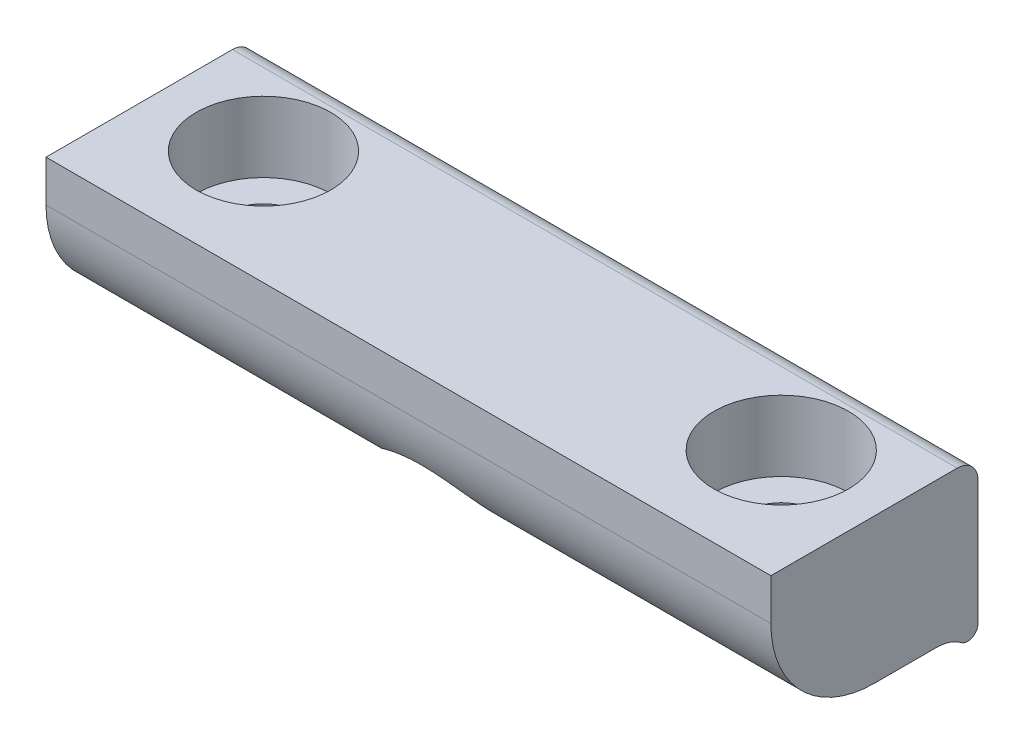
ISO-10303-21;
HEADER;
FILE_DESCRIPTION(('STEP AP214'),'2;1');
FILE_NAME('part.step','',(''),(''),'','','');
FILE_SCHEMA(('AUTOMOTIVE_DESIGN { 1 0 10303 214 1 1 1 1 }'));
ENDSEC;
DATA;
#1=APPLICATION_CONTEXT('core data for automotive mechanical design processes');
#2=APPLICATION_PROTOCOL_DEFINITION('international standard','automotive_design',2000,#1);
#3=PRODUCT_CONTEXT('',#1,'mechanical');
#4=PRODUCT('Part','Part','',(#3));
#5=PRODUCT_RELATED_PRODUCT_CATEGORY('part','',(#4));
#6=PRODUCT_DEFINITION_FORMATION('','',#4);
#7=PRODUCT_DEFINITION_CONTEXT('part definition',#1,'design');
#8=PRODUCT_DEFINITION('design','',#6,#7);
#9=PRODUCT_DEFINITION_SHAPE('','',#8);
#10=(LENGTH_UNIT() NAMED_UNIT(*) SI_UNIT(.MILLI.,.METRE.));
#11=(NAMED_UNIT(*) PLANE_ANGLE_UNIT() SI_UNIT($,.RADIAN.));
#12=(NAMED_UNIT(*) SI_UNIT($,.STERADIAN.) SOLID_ANGLE_UNIT());
#13=UNCERTAINTY_MEASURE_WITH_UNIT(LENGTH_MEASURE(1.E-05),#10,'distance_accuracy_value','');
#14=(GEOMETRIC_REPRESENTATION_CONTEXT(3) GLOBAL_UNCERTAINTY_ASSIGNED_CONTEXT((#13)) GLOBAL_UNIT_ASSIGNED_CONTEXT((#10,
#11,#12)) REPRESENTATION_CONTEXT('',''));
#15=CARTESIAN_POINT('',(0.,0.,0.));
#16=DIRECTION('',(0.,0.,1.));
#17=DIRECTION('',(1.,0.,0.));
#18=AXIS2_PLACEMENT_3D('',#15,#16,#17);
#19=CARTESIAN_POINT('',(-35.,-2.,2.));
#20=DIRECTION('',(1.,0.,0.));
#21=DIRECTION('',(0.,0.,-1.));
#22=AXIS2_PLACEMENT_3D('',#19,#20,#21);
#23=CYLINDRICAL_SURFACE('',#22,2.);
#24=CARTESIAN_POINT('',(-21.2619808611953,0.,2.));
#25=CARTESIAN_POINT('',(-21.261971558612,2.5680852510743E-06,1.94495750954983));
#26=CARTESIAN_POINT('',(-21.2628879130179,-0.00227351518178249,1.88994436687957));
#27=CARTESIAN_POINT('',(-21.2664861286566,-0.0113362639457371,1.78036940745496));
#28=CARTESIAN_POINT('',(-21.2691673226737,-0.0181212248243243,1.72580742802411));
#29=CARTESIAN_POINT('',(-21.2795361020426,-0.0446738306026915,1.56631649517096));
#30=CARTESIAN_POINT('',(-21.2895603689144,-0.0706509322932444,1.46250286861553));
#31=CARTESIAN_POINT('',(-21.3143441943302,-0.138178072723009,1.26194890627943));
#32=CARTESIAN_POINT('',(-21.3290557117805,-0.17957080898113,1.16514853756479));
#33=CARTESIAN_POINT('',(-21.3616131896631,-0.278066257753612,0.976983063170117));
#34=CARTESIAN_POINT('',(-21.3795338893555,-0.335567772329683,0.885839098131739));
#35=CARTESIAN_POINT('',(-21.3977557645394,-0.4,0.799999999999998));
#36=B_SPLINE_CURVE_WITH_KNOTS('',3,(#24,#25,#26,#27,#28,#29,#30,#31,#32,#33,#34,#35),
.UNSPECIFIED.,.F.,.F.,(4,2,2,2,2,4),(0.,0.165016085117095,0.329969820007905,0.650763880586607,
0.968370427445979,1.2946658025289),.UNSPECIFIED.);
#37=CARTESIAN_POINT('',(-21.2619808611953,0.,2.));
#38=VERTEX_POINT('',#37);
#39=CARTESIAN_POINT('',(-21.3977557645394,-0.4,0.799999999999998));
#40=VERTEX_POINT('',#39);
#41=EDGE_CURVE('E213',#38,#40,#36,.T.);
#42=ORIENTED_EDGE('',*,*,#41,.F.);
#43=DIRECTION('',(1.,0.,0.));
#44=VECTOR('',#43,1.);
#45=CARTESIAN_POINT('',(-35.,0.,2.));
#46=LINE('',#45,#44);
#47=CARTESIAN_POINT('',(-35.,0.,2.));
#48=VERTEX_POINT('',#47);
#49=EDGE_CURVE('E159',#48,#38,#46,.T.);
#50=ORIENTED_EDGE('',*,*,#49,.F.);
#51=CARTESIAN_POINT('',(-35.,-2.,2.));
#52=DIRECTION('',(-1.,0.,0.));
#53=DIRECTION('',(0.,0.,-1.));
#54=AXIS2_PLACEMENT_3D('',#51,#52,#53);
#55=CIRCLE('',#54,2.);
#56=CARTESIAN_POINT('',(-35.,-0.4,0.799999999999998));
#57=VERTEX_POINT('',#56);
#58=EDGE_CURVE('E211',#48,#57,#55,.T.);
#59=ORIENTED_EDGE('',*,*,#58,.T.);
#60=DIRECTION('',(1.,0.,0.));
#61=VECTOR('',#60,1.);
#62=CARTESIAN_POINT('',(-35.,-0.4,0.799999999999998));
#63=LINE('',#62,#61);
#64=EDGE_CURVE('E313',#57,#40,#63,.T.);
#65=ORIENTED_EDGE('',*,*,#64,.T.);
#66=EDGE_LOOP('',(#42,#50,#59,#65));
#67=FACE_BOUND('',#66,.T.);
#68=ADVANCED_FACE('F34',(#67),#23,.F.);
#69=CARTESIAN_POINT('',(-35.,0.,2.));
#70=DIRECTION('',(0.,-1.,0.));
#71=DIRECTION('',(0.,0.,-1.));
#72=AXIS2_PLACEMENT_3D('',#69,#70,#71);
#73=PLANE('',#72);
#74=CARTESIAN_POINT('',(-30.,0.,4.5));
#75=DIRECTION('',(0.,-1.,0.));
#76=DIRECTION('',(0.,0.,-1.));
#77=AXIS2_PLACEMENT_3D('',#74,#75,#76);
#78=CIRCLE('',#77,1.7);
#79=CARTESIAN_POINT('',(-31.6248076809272,0.,4.99999999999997));
#80=VERTEX_POINT('',#79);
#81=CARTESIAN_POINT('',(-28.3751923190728,0.,4.99999999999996));
#82=VERTEX_POINT('',#81);
#83=EDGE_CURVE('E53',#80,#82,#78,.T.);
#84=ORIENTED_EDGE('',*,*,#83,.F.);
#85=DIRECTION('',(1.,0.,0.));
#86=VECTOR('',#85,1.);
#87=CARTESIAN_POINT('',(-35.,0.,4.99999999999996));
#88=LINE('',#87,#86);
#89=CARTESIAN_POINT('',(-35.,0.,4.99999999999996));
#90=VERTEX_POINT('',#89);
#91=EDGE_CURVE('E145',#90,#80,#88,.T.);
#92=ORIENTED_EDGE('',*,*,#91,.F.);
#93=DIRECTION('',(0.,0.,-1.));
#94=VECTOR('',#93,1.);
#95=CARTESIAN_POINT('',(-35.,0.,2.));
#96=LINE('',#95,#94);
#97=EDGE_CURVE('E205',#90,#48,#96,.T.);
#98=ORIENTED_EDGE('',*,*,#97,.T.);
#99=ORIENTED_EDGE('',*,*,#49,.T.);
#100=DIRECTION('',(0.,0.,-1.));
#101=VECTOR('',#100,1.);
#102=CARTESIAN_POINT('',(-21.2619808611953,0.,10.));
#103=LINE('',#102,#101);
#104=CARTESIAN_POINT('',(-21.2619808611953,0.,4.99999999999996));
#105=VERTEX_POINT('',#104);
#106=EDGE_CURVE('E204',#105,#38,#103,.T.);
#107=ORIENTED_EDGE('',*,*,#106,.F.);
#108=EDGE_CURVE('E148',#82,#105,#88,.T.);
#109=ORIENTED_EDGE('',*,*,#108,.F.);
#110=EDGE_LOOP('',(#84,#92,#98,#99,#107,#109));
#111=FACE_BOUND('',#110,.T.);
#112=ADVANCED_FACE('F143',(#111),#73,.T.);
#113=CARTESIAN_POINT('',(-35.,0.,0.499999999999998));
#114=DIRECTION('',(1.,0.,0.));
#115=DIRECTION('',(0.,0.,-1.));
#116=AXIS2_PLACEMENT_3D('',#113,#114,#115);
#117=CYLINDRICAL_SURFACE('',#116,0.5);
#118=CARTESIAN_POINT('',(-13.7380191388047,0.,0.));
#119=CARTESIAN_POINT('',(-13.7265863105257,-0.0286359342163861,-2.24437898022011E-05));
#120=CARTESIAN_POINT('',(-13.715497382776,-0.0574339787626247,0.00246020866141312));
#121=CARTESIAN_POINT('',(-13.6942239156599,-0.114550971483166,0.0124402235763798));
#122=CARTESIAN_POINT('',(-13.6840411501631,-0.142868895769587,0.0199471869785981));
#123=CARTESIAN_POINT('',(-13.6648222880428,-0.198163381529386,0.0400012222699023));
#124=CARTESIAN_POINT('',(-13.6557886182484,-0.225137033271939,0.0525587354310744));
#125=CARTESIAN_POINT('',(-13.6390710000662,-0.276701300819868,0.0824798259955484));
#126=CARTESIAN_POINT('',(-13.6313854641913,-0.30129470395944,0.0998376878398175));
#127=CARTESIAN_POINT('',(-13.617800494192,-0.346072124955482,0.13798233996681));
#128=CARTESIAN_POINT('',(-13.6118323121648,-0.366412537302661,0.158561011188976));
#129=CARTESIAN_POINT('',(-13.6012462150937,-0.403373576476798,0.203137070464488));
#130=CARTESIAN_POINT('',(-13.5966283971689,-0.419993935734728,0.227134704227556));
#131=CARTESIAN_POINT('',(-13.5889314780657,-0.448216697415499,0.276667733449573));
#132=CARTESIAN_POINT('',(-13.5857918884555,-0.460013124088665,0.302083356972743));
#133=CARTESIAN_POINT('',(-13.5807392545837,-0.47921865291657,0.35463298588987));
#134=CARTESIAN_POINT('',(-13.5788259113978,-0.48662882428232,0.381766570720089));
#135=CARTESIAN_POINT('',(-13.5762408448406,-0.496685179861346,0.436315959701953));
#136=CARTESIAN_POINT('',(-13.575541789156,-0.499436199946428,0.463711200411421));
#137=CARTESIAN_POINT('',(-13.5752943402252,-0.500407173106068,0.518590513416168));
#138=CARTESIAN_POINT('',(-13.5757460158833,-0.498626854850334,0.546074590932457));
#139=CARTESIAN_POINT('',(-13.5777969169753,-0.490624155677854,0.600152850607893));
#140=CARTESIAN_POINT('',(-13.5793885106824,-0.484431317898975,0.626751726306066));
#141=CARTESIAN_POINT('',(-13.5837234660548,-0.467841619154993,0.678496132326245));
#142=CARTESIAN_POINT('',(-13.5864659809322,-0.457447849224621,0.703642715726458));
#143=CARTESIAN_POINT('',(-13.5915408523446,-0.438636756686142,0.740421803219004));
#144=CARTESIAN_POINT('',(-13.593457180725,-0.431597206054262,0.752837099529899));
#145=CARTESIAN_POINT('',(-13.5976100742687,-0.416527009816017,0.776960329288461));
#146=CARTESIAN_POINT('',(-13.5998460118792,-0.408498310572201,0.788669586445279));
#147=CARTESIAN_POINT('',(-13.6022442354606,-0.4,0.799999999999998));
#148=B_SPLINE_CURVE_WITH_KNOTS('',3,(#118,#119,#120,#121,#122,#123,#124,#125,#126,#127,#128,
#129,#130,#131,#132,#133,#134,#135,#136,#137,#138,#139,#140,#141,#142,#143,#144,#145,#146,#147),
.UNSPECIFIED.,.F.,.F.,(4,2,2,2,2,2,2,2,2,2,2,2,2,2,4),(0.,0.0924351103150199,0.185047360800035,
0.277852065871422,0.37054674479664,0.458727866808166,0.546915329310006,0.631087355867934,
0.715238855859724,0.797470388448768,0.879706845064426,0.961397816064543,1.04302878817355,
1.08618114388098,1.12924990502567),.UNSPECIFIED.);
#149=CARTESIAN_POINT('',(-13.7380191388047,0.,0.));
#150=VERTEX_POINT('',#149);
#151=CARTESIAN_POINT('',(-13.6022442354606,-0.4,0.799999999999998));
#152=VERTEX_POINT('',#151);
#153=EDGE_CURVE('E261',#150,#152,#148,.T.);
#154=ORIENTED_EDGE('',*,*,#153,.F.);
#155=DIRECTION('',(1.,0.,0.));
#156=VECTOR('',#155,1.);
#157=CARTESIAN_POINT('',(-35.,0.,0.));
#158=LINE('',#157,#156);
#159=CARTESIAN_POINT('',(0.,0.,0.));
#160=VERTEX_POINT('',#159);
#161=EDGE_CURVE('E307',#160,#150,#158,.F.);
#162=ORIENTED_EDGE('',*,*,#161,.F.);
#163=CARTESIAN_POINT('',(0.,0.,0.499999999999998));
#164=DIRECTION('',(-1.,0.,0.));
#165=DIRECTION('',(0.,0.,1.));
#166=AXIS2_PLACEMENT_3D('',#163,#164,#165);
#167=CIRCLE('',#166,0.5);
#168=CARTESIAN_POINT('',(0.,-0.4,0.799999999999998));
#169=VERTEX_POINT('',#168);
#170=EDGE_CURVE('E312',#169,#160,#167,.F.);
#171=ORIENTED_EDGE('',*,*,#170,.F.);
#172=EDGE_CURVE('E200',#152,#169,#63,.T.);
#173=ORIENTED_EDGE('',*,*,#172,.F.);
#174=EDGE_LOOP('',(#154,#162,#171,#173));
#175=FACE_BOUND('',#174,.T.);
#176=ADVANCED_FACE('F283',(#175),#117,.T.);
#177=CARTESIAN_POINT('',(-35.,5.,5.));
#178=DIRECTION('',(1.,0.,0.));
#179=DIRECTION('',(0.,0.,-1.));
#180=AXIS2_PLACEMENT_3D('',#177,#178,#179);
#181=CYLINDRICAL_SURFACE('',#180,5.);
#182=CARTESIAN_POINT('',(-28.3751923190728,0.,4.99999999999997));
#183=CARTESIAN_POINT('',(-28.389055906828,-2.95487882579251E-06,5.04505420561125));
#184=CARTESIAN_POINT('',(-28.40478860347,0.000609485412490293,5.08950636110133));
#185=CARTESIAN_POINT('',(-28.4398708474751,0.00294019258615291,5.17691616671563));
#186=CARTESIAN_POINT('',(-28.4592194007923,0.00465815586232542,5.21987422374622));
#187=CARTESIAN_POINT('',(-28.5223972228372,0.011270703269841,5.34586395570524));
#188=CARTESIAN_POINT('',(-28.5714406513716,0.0176253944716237,5.4262762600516));
#189=CARTESIAN_POINT('',(-28.6818950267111,0.0328985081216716,5.57767860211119));
#190=CARTESIAN_POINT('',(-28.7432998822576,0.0418156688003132,5.64867325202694));
#191=CARTESIAN_POINT('',(-28.8768723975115,0.0607054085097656,5.7795812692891));
#192=CARTESIAN_POINT('',(-28.9490439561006,0.0706783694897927,5.83949060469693));
#193=CARTESIAN_POINT('',(-29.1040895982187,0.0903619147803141,5.94793039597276));
#194=CARTESIAN_POINT('',(-29.1871746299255,0.100060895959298,5.99616172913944));
#195=CARTESIAN_POINT('',(-29.360455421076,0.117416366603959,6.07802459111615));
#196=CARTESIAN_POINT('',(-29.4506507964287,0.125072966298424,6.11165690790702));
#197=CARTESIAN_POINT('',(-29.635135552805,0.137095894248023,6.16312761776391));
#198=CARTESIAN_POINT('',(-29.7294001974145,0.141479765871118,6.18105031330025));
#199=CARTESIAN_POINT('',(-29.9196895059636,0.146320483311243,6.20079267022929));
#200=CARTESIAN_POINT('',(-30.0157137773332,0.146778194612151,6.20261588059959));
#201=CARTESIAN_POINT('',(-30.2041303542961,0.143736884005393,6.19027000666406));
#202=CARTESIAN_POINT('',(-30.2965520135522,0.140340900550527,6.17651740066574));
#203=CARTESIAN_POINT('',(-30.4777343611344,0.130278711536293,6.13414425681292));
#204=CARTESIAN_POINT('',(-30.5664947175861,0.123612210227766,6.10552237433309));
#205=CARTESIAN_POINT('',(-30.738533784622,0.107957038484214,6.03404781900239));
#206=CARTESIAN_POINT('',(-30.8217733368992,0.0989536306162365,5.99110432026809));
#207=CARTESIAN_POINT('',(-30.980033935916,0.0799907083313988,5.89220810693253));
#208=CARTESIAN_POINT('',(-31.0550524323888,0.0700308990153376,5.83625137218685));
#209=CARTESIAN_POINT('',(-31.1968423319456,0.0504083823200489,5.71109556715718));
#210=CARTESIAN_POINT('',(-31.2633365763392,0.0407609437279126,5.64157991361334));
#211=CARTESIAN_POINT('',(-31.3837361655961,0.0237194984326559,5.49219747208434));
#212=CARTESIAN_POINT('',(-31.4376538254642,0.0163232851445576,5.41234093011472));
#213=CARTESIAN_POINT('',(-31.5135233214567,0.00737295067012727,5.27640770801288));
#214=CARTESIAN_POINT('',(-31.5398431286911,0.00466701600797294,5.22279857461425));
#215=CARTESIAN_POINT('',(-31.5867107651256,0.00097641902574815,5.11311337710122));
#216=CARTESIAN_POINT('',(-31.6072635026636,-9.71076704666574E-06,5.05703945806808));
#217=CARTESIAN_POINT('',(-31.6248076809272,0.,4.99999999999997));
#218=B_SPLINE_CURVE_WITH_KNOTS('',3,(#182,#183,#184,#185,#186,#187,#188,#189,#190,#191,#192,
#193,#194,#195,#196,#197,#198,#199,#200,#201,#202,#203,#204,#205,#206,#207,#208,#209,#210,#211,
#212,#213,#214,#215,#216,#217),.UNSPECIFIED.,.F.,.F.,(4,2,2,2,2,2,2,2,2,2,2,2,2,2,2,2,2,4),(0.,
0.141322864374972,0.282606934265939,0.564353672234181,0.845961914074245,1.12767238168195,
1.41597592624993,1.70426390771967,1.99099520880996,2.27766330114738,2.55684356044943,
2.83604907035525,3.11706004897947,3.39815795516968,3.68684090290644,3.97523997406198,
4.1542617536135,4.33313070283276),.UNSPECIFIED.);
#219=EDGE_CURVE('E11',#82,#80,#218,.T.);
#220=ORIENTED_EDGE('',*,*,#219,.F.);
#221=ORIENTED_EDGE('',*,*,#108,.T.);
#222=CARTESIAN_POINT('',(-13.7380191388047,0.,4.99999999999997));
#223=CARTESIAN_POINT('',(-13.7380573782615,-1.68040516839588E-05,5.12587017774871));
#224=CARTESIAN_POINT('',(-13.7399156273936,0.00475236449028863,5.25174490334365));
#225=CARTESIAN_POINT('',(-13.7475487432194,0.0237470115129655,5.502692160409));
#226=CARTESIAN_POINT('',(-13.7533246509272,0.0379750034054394,5.62776446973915));
#227=CARTESIAN_POINT('',(-13.7691145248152,0.0758785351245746,5.87693110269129));
#228=CARTESIAN_POINT('',(-13.7791522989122,0.0996071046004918,6.00101588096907));
#229=CARTESIAN_POINT('',(-13.8040158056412,0.156249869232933,6.24657765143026));
#230=CARTESIAN_POINT('',(-13.8188411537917,0.189163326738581,6.36805485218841));
#231=CARTESIAN_POINT('',(-13.8540616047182,0.263899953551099,6.60784827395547));
#232=CARTESIAN_POINT('',(-13.8744741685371,0.305750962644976,6.72615328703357));
#233=CARTESIAN_POINT('',(-13.921748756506,0.39770632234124,6.95817752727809));
#234=CARTESIAN_POINT('',(-13.9486100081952,0.447809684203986,7.07189730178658));
#235=CARTESIAN_POINT('',(-14.0097011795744,0.555266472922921,7.29334742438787));
#236=CARTESIAN_POINT('',(-14.0439078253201,0.612596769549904,7.40109536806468));
#237=CARTESIAN_POINT('',(-14.1207742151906,0.73348519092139,7.60986288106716));
#238=CARTESIAN_POINT('',(-14.1634311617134,0.79704125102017,7.71088466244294));
#239=CARTESIAN_POINT('',(-14.2470154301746,0.913388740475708,7.88230588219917));
#240=CARTESIAN_POINT('',(-14.2859962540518,0.965202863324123,7.95432519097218));
#241=CARTESIAN_POINT('',(-14.3698169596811,1.07079694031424,8.09337692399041));
#242=CARTESIAN_POINT('',(-14.4146576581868,1.12457716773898,8.16040865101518));
#243=CARTESIAN_POINT('',(-14.5104102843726,1.23314627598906,8.28905714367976));
#244=CARTESIAN_POINT('',(-14.5613200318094,1.28793478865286,8.35067584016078));
#245=CARTESIAN_POINT('',(-14.6693144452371,1.39752222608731,8.4682288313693));
#246=CARTESIAN_POINT('',(-14.7263986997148,1.45232114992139,8.52416350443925));
#247=CARTESIAN_POINT('',(-14.8468490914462,1.56102737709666,8.63032468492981));
#248=CARTESIAN_POINT('',(-14.9102325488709,1.6149317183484,8.68053459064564));
#249=CARTESIAN_POINT('',(-15.042891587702,1.72060646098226,8.77499682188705));
#250=CARTESIAN_POINT('',(-15.1121650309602,1.77237762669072,8.81925129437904));
#251=CARTESIAN_POINT('',(-15.2562773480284,1.87282169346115,8.90192143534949));
#252=CARTESIAN_POINT('',(-15.3311186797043,1.9214932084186,8.94033450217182));
#253=CARTESIAN_POINT('',(-15.4858407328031,2.01480057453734,9.01148710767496));
#254=CARTESIAN_POINT('',(-15.5657213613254,2.0594365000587,9.04422675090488));
#255=CARTESIAN_POINT('',(-15.7261847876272,2.14195625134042,9.10292977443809));
#256=CARTESIAN_POINT('',(-15.8065691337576,2.180055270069,9.12913423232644));
#257=CARTESIAN_POINT('',(-15.9708673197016,2.25130289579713,9.17690141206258));
#258=CARTESIAN_POINT('',(-16.0547823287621,2.28444984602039,9.1984625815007));
#259=CARTESIAN_POINT('',(-16.2255138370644,2.3453084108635,9.2372059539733));
#260=CARTESIAN_POINT('',(-16.3123295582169,2.37302146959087,9.25438932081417));
#261=CARTESIAN_POINT('',(-16.4883290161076,2.42267588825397,9.28465242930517));
#262=CARTESIAN_POINT('',(-16.5775136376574,2.44461505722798,9.29773061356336));
#263=CARTESIAN_POINT('',(-16.7607033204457,2.48308870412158,9.32037889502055));
#264=CARTESIAN_POINT('',(-16.8547690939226,2.4994135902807,9.32981429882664));
#265=CARTESIAN_POINT('',(-17.0441587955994,2.52540043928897,9.34471880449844));
#266=CARTESIAN_POINT('',(-17.1394831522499,2.53506007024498,9.35018651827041));
#267=CARTESIAN_POINT('',(-17.3307246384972,2.54759544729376,9.35726564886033));
#268=CARTESIAN_POINT('',(-17.4266418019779,2.55047080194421,9.35887684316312));
#269=CARTESIAN_POINT('',(-17.6184265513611,2.54940381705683,9.35827700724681));
#270=CARTESIAN_POINT('',(-17.7142941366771,2.54546139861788,9.35606593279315));
#271=CARTESIAN_POINT('',(-17.9084153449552,2.53056747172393,9.34764065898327));
#272=CARTESIAN_POINT('',(-18.006646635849,2.51939478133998,9.34130009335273));
#273=CARTESIAN_POINT('',(-18.2016380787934,2.48997773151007,9.3243584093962));
#274=CARTESIAN_POINT('',(-18.2983987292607,2.47173582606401,9.31375876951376));
#275=CARTESIAN_POINT('',(-18.4898054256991,2.4284113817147,9.28807251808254));
#276=CARTESIAN_POINT('',(-18.5844507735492,2.40332661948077,9.27298444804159));
#277=CARTESIAN_POINT('',(-18.7708387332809,2.34668056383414,9.23804224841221));
#278=CARTESIAN_POINT('',(-18.86258255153,2.31512200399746,9.21819012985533));
#279=CARTESIAN_POINT('',(-19.0415516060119,2.2463597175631,9.17362249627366));
#280=CARTESIAN_POINT('',(-19.1288141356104,2.20921865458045,9.14896016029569));
#281=CARTESIAN_POINT('',(-19.2991305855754,2.12966375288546,9.0943248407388));
#282=CARTESIAN_POINT('',(-19.3821862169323,2.08725208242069,9.06435403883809));
#283=CARTESIAN_POINT('',(-19.5434684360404,1.99788980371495,8.99880002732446));
#284=CARTESIAN_POINT('',(-19.6216964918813,1.95094058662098,8.96321853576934));
#285=CARTESIAN_POINT('',(-19.7727855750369,1.8533615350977,8.88619722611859));
#286=CARTESIAN_POINT('',(-19.8456468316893,1.80273185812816,8.84475765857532));
#287=CARTESIAN_POINT('',(-19.9825385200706,1.70100863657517,8.75778282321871));
#288=CARTESIAN_POINT('',(-20.0468140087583,1.65002875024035,8.71250044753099));
#289=CARTESIAN_POINT('',(-20.1697686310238,1.54652396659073,8.61642205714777));
#290=CARTESIAN_POINT('',(-20.2284458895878,1.49399855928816,8.56562420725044));
#291=CARTESIAN_POINT('',(-20.3957561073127,1.33559475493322,8.40508443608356));
#292=CARTESIAN_POINT('',(-20.4958097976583,1.2287796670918,8.28710631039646));
#293=CARTESIAN_POINT('',(-20.673379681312,1.02013466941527,8.03117441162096));
#294=CARTESIAN_POINT('',(-20.7508493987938,0.918315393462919,7.89318030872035));
#295=CARTESIAN_POINT('',(-20.8855210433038,0.725883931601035,7.60050653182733));
#296=CARTESIAN_POINT('',(-20.9427137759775,0.63527684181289,7.44581932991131));
#297=CARTESIAN_POINT('',(-21.045488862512,0.460470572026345,7.10552016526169));
#298=CARTESIAN_POINT('',(-21.0890830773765,0.37809327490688,6.91838071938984));
#299=CARTESIAN_POINT('',(-21.1598333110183,0.23621319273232,6.53252596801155));
#300=CARTESIAN_POINT('',(-21.1869760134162,0.176728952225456,6.33380142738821));
#301=CARTESIAN_POINT('',(-21.2170563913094,0.108261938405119,6.03920780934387));
#302=CARTESIAN_POINT('',(-21.2251372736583,0.0893880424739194,5.9460202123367));
#303=CARTESIAN_POINT('',(-21.2388101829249,0.0569571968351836,5.75852895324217));
#304=CARTESIAN_POINT('',(-21.2444022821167,0.0434000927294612,5.66422532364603));
#305=CARTESIAN_POINT('',(-21.2532680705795,0.0217164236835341,5.47511229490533));
#306=CARTESIAN_POINT('',(-21.2565470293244,0.0135775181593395,5.38030454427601));
#307=CARTESIAN_POINT('',(-21.2608971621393,0.00271703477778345,5.19033154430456));
#308=CARTESIAN_POINT('',(-21.2619684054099,-4.7128795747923E-06,5.0951663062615));
#309=CARTESIAN_POINT('',(-21.2619808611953,0.,4.99999999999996));
#310=B_SPLINE_CURVE_WITH_KNOTS('',3,(#222,#223,#224,#225,#226,#227,#228,#229,#230,#231,#232,
#233,#234,#235,#236,#237,#238,#239,#240,#241,#242,#243,#244,#245,#246,#247,#248,#249,#250,#251,
#252,#253,#254,#255,#256,#257,#258,#259,#260,#261,#262,#263,#264,#265,#266,#267,#268,#269,#270,
#271,#272,#273,#274,#275,#276,#277,#278,#279,#280,#281,#282,#283,#284,#285,#286,#287,#288,#289,
#290,#291,#292,#293,#294,#295,#296,#297,#298,#299,#300,#301,#302,#303,#304,#305,#306,#307,#308,
#309),.UNSPECIFIED.,.F.,.F.,(4,2,2,2,2,2,2,2,2,2,2,2,2,2,2,2,2,2,2,2,2,2,2,2,2,2,2,2,2,2,2,2,2,
2,2,2,2,2,2,2,2,2,2,4),(0.,0.377514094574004,0.755128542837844,1.1348807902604,1.51460254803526,
1.89552482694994,2.27640149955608,2.65608871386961,3.03565043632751,3.32607256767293,
3.61653522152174,3.90689384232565,4.19723312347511,4.48839404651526,4.77944972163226,
5.07063465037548,5.3618142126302,5.63970388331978,5.91768631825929,6.19559477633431,
6.47360853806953,6.76109373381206,7.04867945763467,7.33628177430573,7.62388741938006,
7.92073595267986,8.21748153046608,8.51432363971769,8.81104066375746,9.1046463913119,
9.39813173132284,9.69152737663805,9.98491047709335,10.2656721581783,10.5465275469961,
11.1076443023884,11.6699077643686,12.2324258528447,12.8572610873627,13.4826014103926,
13.7687240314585,14.054838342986,14.340298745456,14.6257502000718),.UNSPECIFIED.);
#311=CARTESIAN_POINT('',(-13.7380191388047,0.,4.99999999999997));
#312=VERTEX_POINT('',#311);
#313=EDGE_CURVE('E274',#312,#105,#310,.T.);
#314=ORIENTED_EDGE('',*,*,#313,.F.);
#315=CARTESIAN_POINT('',(-6.6248076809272,0.,4.99999999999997));
#316=VERTEX_POINT('',#315);
#317=EDGE_CURVE('E158',#312,#316,#88,.T.);
#318=ORIENTED_EDGE('',*,*,#317,.T.);
#319=CARTESIAN_POINT('',(-3.3751923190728,0.,4.99999999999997));
#320=CARTESIAN_POINT('',(-3.38905590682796,-2.95487882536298E-06,5.04505420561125));
#321=CARTESIAN_POINT('',(-3.40478860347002,0.00060948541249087,5.08950636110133));
#322=CARTESIAN_POINT('',(-3.43987084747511,0.00294019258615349,5.17691616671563));
#323=CARTESIAN_POINT('',(-3.45921940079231,0.00465815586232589,5.21987422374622));
#324=CARTESIAN_POINT('',(-3.52239722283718,0.011270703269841,5.34586395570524));
#325=CARTESIAN_POINT('',(-3.57144065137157,0.0176253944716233,5.4262762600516));
#326=CARTESIAN_POINT('',(-3.68189502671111,0.0328985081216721,5.57767860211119));
#327=CARTESIAN_POINT('',(-3.74329988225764,0.0418156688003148,5.64867325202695));
#328=CARTESIAN_POINT('',(-3.87687239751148,0.0607054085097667,5.7795812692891));
#329=CARTESIAN_POINT('',(-3.94904395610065,0.070678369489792,5.83949060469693));
#330=CARTESIAN_POINT('',(-4.10408959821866,0.0903619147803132,5.94793039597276));
#331=CARTESIAN_POINT('',(-4.18717462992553,0.100060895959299,5.99616172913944));
#332=CARTESIAN_POINT('',(-4.36045542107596,0.11741636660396,6.07802459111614));
#333=CARTESIAN_POINT('',(-4.45065079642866,0.125072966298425,6.11165690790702));
#334=CARTESIAN_POINT('',(-4.63513555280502,0.137095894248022,6.16312761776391));
#335=CARTESIAN_POINT('',(-4.72940019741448,0.141479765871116,6.18105031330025));
#336=CARTESIAN_POINT('',(-4.9196895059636,0.146320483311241,6.20079267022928));
#337=CARTESIAN_POINT('',(-5.0157137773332,0.14677819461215,6.20261588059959));
#338=CARTESIAN_POINT('',(-5.20413035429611,0.143736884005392,6.19027000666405));
#339=CARTESIAN_POINT('',(-5.2965520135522,0.140340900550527,6.17651740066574));
#340=CARTESIAN_POINT('',(-5.47773436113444,0.130278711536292,6.13414425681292));
#341=CARTESIAN_POINT('',(-5.56649471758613,0.123612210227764,6.10552237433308));
#342=CARTESIAN_POINT('',(-5.73853378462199,0.107957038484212,6.03404781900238));
#343=CARTESIAN_POINT('',(-5.82177333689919,0.0989536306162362,5.99110432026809));
#344=CARTESIAN_POINT('',(-5.98003393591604,0.0799907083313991,5.89220810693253));
#345=CARTESIAN_POINT('',(-6.05505243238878,0.0700308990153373,5.83625137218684));
#346=CARTESIAN_POINT('',(-6.19684233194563,0.050408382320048,5.71109556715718));
#347=CARTESIAN_POINT('',(-6.2633365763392,0.0407609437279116,5.64157991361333));
#348=CARTESIAN_POINT('',(-6.38373616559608,0.0237194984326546,5.49219747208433));
#349=CARTESIAN_POINT('',(-6.43765382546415,0.0163232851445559,5.41234093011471));
#350=CARTESIAN_POINT('',(-6.51352332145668,0.00737295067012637,5.27640770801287));
#351=CARTESIAN_POINT('',(-6.53984312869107,0.0046670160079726,5.22279857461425));
#352=CARTESIAN_POINT('',(-6.58671076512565,0.000976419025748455,5.11311337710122));
#353=CARTESIAN_POINT('',(-6.60726350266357,-9.7107670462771E-06,5.05703945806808));
#354=CARTESIAN_POINT('',(-6.6248076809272,0.,4.99999999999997));
#355=B_SPLINE_CURVE_WITH_KNOTS('',3,(#319,#320,#321,#322,#323,#324,#325,#326,#327,#328,#329,
#330,#331,#332,#333,#334,#335,#336,#337,#338,#339,#340,#341,#342,#343,#344,#345,#346,#347,#348,
#349,#350,#351,#352,#353,#354),.UNSPECIFIED.,.F.,.F.,(4,2,2,2,2,2,2,2,2,2,2,2,2,2,2,2,2,4),(0.,
0.141322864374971,0.28260693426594,0.564353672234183,0.845961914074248,1.12767238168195,
1.41597592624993,1.70426390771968,1.99099520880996,2.27766330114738,2.55684356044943,
2.83604907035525,3.11706004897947,3.39815795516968,3.68684090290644,3.97523997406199,
4.1542617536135,4.33313070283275),.UNSPECIFIED.);
#356=CARTESIAN_POINT('',(-3.3751923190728,0.,4.99999999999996));
#357=VERTEX_POINT('',#356);
#358=EDGE_CURVE('E48',#357,#316,#355,.T.);
#359=ORIENTED_EDGE('',*,*,#358,.F.);
#360=CARTESIAN_POINT('',(0.,0.,4.99999999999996));
#361=VERTEX_POINT('',#360);
#362=EDGE_CURVE('E161',#357,#361,#88,.T.);
#363=ORIENTED_EDGE('',*,*,#362,.T.);
#364=CARTESIAN_POINT('',(0.,5.,5.));
#365=DIRECTION('',(1.,0.,0.));
#366=DIRECTION('',(0.,0.,1.));
#367=AXIS2_PLACEMENT_3D('',#364,#365,#366);
#368=CIRCLE('',#367,5.);
#369=CARTESIAN_POINT('',(0.,5.00000000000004,10.));
#370=VERTEX_POINT('',#369);
#371=EDGE_CURVE('E180',#370,#361,#368,.T.);
#372=ORIENTED_EDGE('',*,*,#371,.F.);
#373=DIRECTION('',(1.,0.,0.));
#374=VECTOR('',#373,1.);
#375=CARTESIAN_POINT('',(-35.,5.00000000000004,10.));
#376=LINE('',#375,#374);
#377=CARTESIAN_POINT('',(-35.,5.00000000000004,10.));
#378=VERTEX_POINT('',#377);
#379=EDGE_CURVE('E198',#378,#370,#376,.T.);
#380=ORIENTED_EDGE('',*,*,#379,.F.);
#381=CARTESIAN_POINT('',(-35.,5.,5.));
#382=DIRECTION('',(1.,0.,0.));
#383=DIRECTION('',(0.,0.,1.));
#384=AXIS2_PLACEMENT_3D('',#381,#382,#383);
#385=CIRCLE('',#384,5.);
#386=EDGE_CURVE('E155',#378,#90,#385,.T.);
#387=ORIENTED_EDGE('',*,*,#386,.T.);
#388=ORIENTED_EDGE('',*,*,#91,.T.);
#389=EDGE_LOOP('',(#220,#221,#314,#318,#359,#363,#372,#380,#387,#388));
#390=FACE_BOUND('',#389,.T.);
#391=ADVANCED_FACE('F153',(#390),#181,.T.);
#392=CARTESIAN_POINT('',(-35.,5.00000000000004,10.));
#393=DIRECTION('',(0.,0.,1.));
#394=DIRECTION('',(0.,-1.,0.));
#395=AXIS2_PLACEMENT_3D('',#392,#393,#394);
#396=PLANE('',#395);
#397=DIRECTION('',(0.,-1.,0.));
#398=VECTOR('',#397,1.);
#399=CARTESIAN_POINT('',(0.,5.00000000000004,10.));
#400=LINE('',#399,#398);
#401=CARTESIAN_POINT('',(0.,7.,10.));
#402=VERTEX_POINT('',#401);
#403=EDGE_CURVE('E195',#402,#370,#400,.T.);
#404=ORIENTED_EDGE('',*,*,#403,.F.);
#405=DIRECTION('',(1.,0.,0.));
#406=VECTOR('',#405,1.);
#407=CARTESIAN_POINT('',(-35.,7.,10.));
#408=LINE('',#407,#406);
#409=CARTESIAN_POINT('',(-35.,7.,10.));
#410=VERTEX_POINT('',#409);
#411=EDGE_CURVE('E201',#410,#402,#408,.T.);
#412=ORIENTED_EDGE('',*,*,#411,.F.);
#413=DIRECTION('',(0.,-1.,0.));
#414=VECTOR('',#413,1.);
#415=CARTESIAN_POINT('',(-35.,5.00000000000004,10.));
#416=LINE('',#415,#414);
#417=EDGE_CURVE('E166',#410,#378,#416,.T.);
#418=ORIENTED_EDGE('',*,*,#417,.T.);
#419=ORIENTED_EDGE('',*,*,#379,.T.);
#420=EDGE_LOOP('',(#404,#412,#418,#419));
#421=FACE_BOUND('',#420,.T.);
#422=ADVANCED_FACE('F282',(#421),#396,.T.);
#423=CARTESIAN_POINT('',(-35.,7.,10.));
#424=DIRECTION('',(0.,1.,0.));
#425=DIRECTION('',(0.,0.,1.));
#426=AXIS2_PLACEMENT_3D('',#423,#424,#425);
#427=PLANE('',#426);
#428=CARTESIAN_POINT('',(-30.,7.,4.5));
#429=DIRECTION('',(0.,1.,0.));
#430=DIRECTION('',(0.,0.,1.));
#431=AXIS2_PLACEMENT_3D('',#428,#429,#430);
#432=CIRCLE('',#431,3.25);
#433=CARTESIAN_POINT('',(-30.,7.,7.75));
#434=VERTEX_POINT('',#433);
#435=EDGE_CURVE('E341',#434,#434,#432,.T.);
#436=ORIENTED_EDGE('',*,*,#435,.F.);
#437=EDGE_LOOP('',(#436));
#438=FACE_BOUND('',#437,.T.);
#439=CARTESIAN_POINT('',(-5.,7.,4.5));
#440=DIRECTION('',(0.,1.,0.));
#441=DIRECTION('',(0.,0.,1.));
#442=AXIS2_PLACEMENT_3D('',#439,#440,#441);
#443=CIRCLE('',#442,3.25);
#444=CARTESIAN_POINT('',(-5.,7.,7.75));
#445=VERTEX_POINT('',#444);
#446=EDGE_CURVE('E149',#445,#445,#443,.T.);
#447=ORIENTED_EDGE('',*,*,#446,.F.);
#448=EDGE_LOOP('',(#447));
#449=FACE_BOUND('',#448,.T.);
#450=DIRECTION('',(0.,0.,1.));
#451=VECTOR('',#450,1.);
#452=CARTESIAN_POINT('',(0.,7.,10.));
#453=LINE('',#452,#451);
#454=CARTESIAN_POINT('',(0.,7.,1.));
#455=VERTEX_POINT('',#454);
#456=EDGE_CURVE('E193',#455,#402,#453,.T.);
#457=ORIENTED_EDGE('',*,*,#456,.F.);
#458=DIRECTION('',(1.,0.,0.));
#459=VECTOR('',#458,1.);
#460=CARTESIAN_POINT('',(-35.,7.,1.));
#461=LINE('',#460,#459);
#462=CARTESIAN_POINT('',(-35.,7.,1.));
#463=VERTEX_POINT('',#462);
#464=EDGE_CURVE('E295',#455,#463,#461,.F.);
#465=ORIENTED_EDGE('',*,*,#464,.T.);
#466=DIRECTION('',(0.,0.,1.));
#467=VECTOR('',#466,1.);
#468=CARTESIAN_POINT('',(-35.,7.,10.));
#469=LINE('',#468,#467);
#470=EDGE_CURVE('E171',#463,#410,#469,.T.);
#471=ORIENTED_EDGE('',*,*,#470,.T.);
#472=ORIENTED_EDGE('',*,*,#411,.T.);
#473=EDGE_LOOP('',(#457,#465,#471,#472));
#474=FACE_BOUND('',#473,.T.);
#475=ADVANCED_FACE('F347',(#438,#449,#474),#427,.T.);
#476=CARTESIAN_POINT('',(-35.,7.,0.));
#477=DIRECTION('',(0.,0.,-1.));
#478=DIRECTION('',(0.,1.,0.));
#479=AXIS2_PLACEMENT_3D('',#476,#477,#478);
#480=PLANE('',#479);
#481=DIRECTION('',(0.,1.,0.));
#482=VECTOR('',#481,1.);
#483=CARTESIAN_POINT('',(-35.,7.,0.));
#484=LINE('',#483,#482);
#485=CARTESIAN_POINT('',(-35.,0.,0.));
#486=VERTEX_POINT('',#485);
#487=CARTESIAN_POINT('',(-35.,6.,0.));
#488=VERTEX_POINT('',#487);
#489=EDGE_CURVE('E176',#486,#488,#484,.T.);
#490=ORIENTED_EDGE('',*,*,#489,.T.);
#491=DIRECTION('',(1.,0.,0.));
#492=VECTOR('',#491,1.);
#493=CARTESIAN_POINT('',(-35.,6.,0.));
#494=LINE('',#493,#492);
#495=CARTESIAN_POINT('',(0.,6.,0.));
#496=VERTEX_POINT('',#495);
#497=EDGE_CURVE('E298',#488,#496,#494,.T.);
#498=ORIENTED_EDGE('',*,*,#497,.T.);
#499=DIRECTION('',(0.,1.,0.));
#500=VECTOR('',#499,1.);
#501=CARTESIAN_POINT('',(0.,7.,0.));
#502=LINE('',#501,#500);
#503=EDGE_CURVE('E190',#160,#496,#502,.T.);
#504=ORIENTED_EDGE('',*,*,#503,.F.);
#505=ORIENTED_EDGE('',*,*,#161,.T.);
#506=CARTESIAN_POINT('',(-17.5,-1.5,0.));
#507=DIRECTION('',(0.,0.,-1.));
#508=DIRECTION('',(0.,1.,0.));
#509=AXIS2_PLACEMENT_3D('',#506,#507,#508);
#510=CIRCLE('',#509,4.05);
#511=CARTESIAN_POINT('',(-21.2619808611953,0.,0.));
#512=VERTEX_POINT('',#511);
#513=EDGE_CURVE('E325',#512,#150,#510,.T.);
#514=ORIENTED_EDGE('',*,*,#513,.F.);
#515=EDGE_CURVE('E309',#512,#486,#158,.F.);
#516=ORIENTED_EDGE('',*,*,#515,.T.);
#517=EDGE_LOOP('',(#490,#498,#504,#505,#514,#516));
#518=FACE_BOUND('',#517,.T.);
#519=ADVANCED_FACE('F350',(#518),#480,.T.);
#520=CARTESIAN_POINT('',(-13.6022442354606,-0.4,0.799999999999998));
#521=CARTESIAN_POINT('',(-13.6116531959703,-0.366663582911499,0.84445242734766));
#522=CARTESIAN_POINT('',(-13.6209978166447,-0.335183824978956,0.890282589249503));
#523=CARTESIAN_POINT('',(-13.6392314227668,-0.2761034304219,0.984481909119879));
#524=CARTESIAN_POINT('',(-13.6481202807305,-0.248503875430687,1.03285176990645));
#525=CARTESIAN_POINT('',(-13.673119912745,-0.173259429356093,1.17858246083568));
#526=CARTESIAN_POINT('',(-13.6881370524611,-0.131252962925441,1.27913116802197));
#527=CARTESIAN_POINT('',(-13.7122500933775,-0.0659115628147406,1.48051393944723));
#528=CARTESIAN_POINT('',(-13.721630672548,-0.041662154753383,1.58101620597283));
#529=CARTESIAN_POINT('',(-13.7313180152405,-0.0168918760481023,1.73523776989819));
#530=CARTESIAN_POINT('',(-13.7338189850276,-0.0105665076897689,1.78794132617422));
#531=CARTESIAN_POINT('',(-13.7371739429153,-0.00211822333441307,1.89375544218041));
#532=CARTESIAN_POINT('',(-13.7380273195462,3.13243880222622E-06,1.94686614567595));
#533=CARTESIAN_POINT('',(-13.7380191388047,0.,2.));
#534=B_SPLINE_CURVE_WITH_KNOTS('',3,(#520,#521,#522,#523,#524,#525,#526,#527,#528,#529,#530,
#531,#532,#533),.UNSPECIFIED.,.F.,.F.,(4,2,2,2,2,2,4),(0.,0.168970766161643,0.337988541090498,
0.666381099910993,0.976369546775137,1.13561821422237,1.29492597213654),.UNSPECIFIED.);
#535=CARTESIAN_POINT('',(-13.7380191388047,0.,2.));
#536=VERTEX_POINT('',#535);
#537=EDGE_CURVE('E184',#152,#536,#534,.T.);
#538=ORIENTED_EDGE('',*,*,#537,.F.);
#539=ORIENTED_EDGE('',*,*,#172,.T.);
#540=CARTESIAN_POINT('',(0.,-2.,2.));
#541=DIRECTION('',(-1.,0.,0.));
#542=DIRECTION('',(0.,0.,-1.));
#543=AXIS2_PLACEMENT_3D('',#540,#541,#542);
#544=CIRCLE('',#543,2.);
#545=CARTESIAN_POINT('',(0.,0.,2.));
#546=VERTEX_POINT('',#545);
#547=EDGE_CURVE('E187',#546,#169,#544,.T.);
#548=ORIENTED_EDGE('',*,*,#547,.F.);
#549=EDGE_CURVE('E156',#536,#546,#46,.T.);
#550=ORIENTED_EDGE('',*,*,#549,.F.);
#551=EDGE_LOOP('',(#538,#539,#548,#550));
#552=FACE_BOUND('',#551,.T.);
#553=ADVANCED_FACE('F234',(#552),#23,.F.);
#554=CARTESIAN_POINT('',(-5.,0.,4.5));
#555=DIRECTION('',(0.,-1.,0.));
#556=DIRECTION('',(0.,0.,-1.));
#557=AXIS2_PLACEMENT_3D('',#554,#555,#556);
#558=CIRCLE('',#557,1.7);
#559=EDGE_CURVE('E60',#316,#357,#558,.T.);
#560=ORIENTED_EDGE('',*,*,#559,.F.);
#561=ORIENTED_EDGE('',*,*,#317,.F.);
#562=DIRECTION('',(0.,0.,-1.));
#563=VECTOR('',#562,1.);
#564=CARTESIAN_POINT('',(-13.7380191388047,0.,10.));
#565=LINE('',#564,#563);
#566=EDGE_CURVE('E232',#536,#312,#565,.F.);
#567=ORIENTED_EDGE('',*,*,#566,.F.);
#568=ORIENTED_EDGE('',*,*,#549,.T.);
#569=DIRECTION('',(0.,0.,-1.));
#570=VECTOR('',#569,1.);
#571=CARTESIAN_POINT('',(0.,0.,2.));
#572=LINE('',#571,#570);
#573=EDGE_CURVE('E183',#361,#546,#572,.T.);
#574=ORIENTED_EDGE('',*,*,#573,.F.);
#575=ORIENTED_EDGE('',*,*,#362,.F.);
#576=EDGE_LOOP('',(#560,#561,#567,#568,#574,#575));
#577=FACE_BOUND('',#576,.T.);
#578=ADVANCED_FACE('F284',(#577),#73,.T.);
#579=CARTESIAN_POINT('',(-35.,5.,5.));
#580=DIRECTION('',(-1.,0.,0.));
#581=DIRECTION('',(0.,0.,1.));
#582=AXIS2_PLACEMENT_3D('',#579,#580,#581);
#583=PLANE('',#582);
#584=ORIENTED_EDGE('',*,*,#470,.F.);
#585=CARTESIAN_POINT('',(-35.,6.,1.));
#586=DIRECTION('',(-1.,0.,0.));
#587=DIRECTION('',(0.,0.,1.));
#588=AXIS2_PLACEMENT_3D('',#585,#586,#587);
#589=CIRCLE('',#588,1.);
#590=EDGE_CURVE('E293',#463,#488,#589,.T.);
#591=ORIENTED_EDGE('',*,*,#590,.T.);
#592=ORIENTED_EDGE('',*,*,#489,.F.);
#593=CARTESIAN_POINT('',(-35.,0.,0.499999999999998));
#594=DIRECTION('',(-1.,0.,0.));
#595=DIRECTION('',(0.,0.,1.));
#596=AXIS2_PLACEMENT_3D('',#593,#594,#595);
#597=CIRCLE('',#596,0.5);
#598=EDGE_CURVE('E219',#486,#57,#597,.T.);
#599=ORIENTED_EDGE('',*,*,#598,.T.);
#600=ORIENTED_EDGE('',*,*,#58,.F.);
#601=ORIENTED_EDGE('',*,*,#97,.F.);
#602=ORIENTED_EDGE('',*,*,#386,.F.);
#603=ORIENTED_EDGE('',*,*,#417,.F.);
#604=EDGE_LOOP('',(#584,#591,#592,#599,#600,#601,#602,#603));
#605=FACE_BOUND('',#604,.T.);
#606=ADVANCED_FACE('F216',(#605),#583,.T.);
#607=CARTESIAN_POINT('',(0.,5.,5.));
#608=DIRECTION('',(-1.,0.,0.));
#609=DIRECTION('',(0.,0.,1.));
#610=AXIS2_PLACEMENT_3D('',#607,#608,#609);
#611=PLANE('',#610);
#612=ORIENTED_EDGE('',*,*,#503,.T.);
#613=CARTESIAN_POINT('',(0.,6.,1.));
#614=DIRECTION('',(-1.,0.,0.));
#615=DIRECTION('',(0.,0.,1.));
#616=AXIS2_PLACEMENT_3D('',#613,#614,#615);
#617=CIRCLE('',#616,1.);
#618=EDGE_CURVE('E297',#496,#455,#617,.F.);
#619=ORIENTED_EDGE('',*,*,#618,.T.);
#620=ORIENTED_EDGE('',*,*,#456,.T.);
#621=ORIENTED_EDGE('',*,*,#403,.T.);
#622=ORIENTED_EDGE('',*,*,#371,.T.);
#623=ORIENTED_EDGE('',*,*,#573,.T.);
#624=ORIENTED_EDGE('',*,*,#547,.T.);
#625=ORIENTED_EDGE('',*,*,#170,.T.);
#626=EDGE_LOOP('',(#612,#619,#620,#621,#622,#623,#624,#625));
#627=FACE_BOUND('',#626,.T.);
#628=ADVANCED_FACE('F322',(#627),#611,.F.);
#629=CARTESIAN_POINT('',(-21.3977557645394,-0.4,0.799999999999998));
#630=CARTESIAN_POINT('',(-21.4023501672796,-0.416294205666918,0.778320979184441));
#631=CARTESIAN_POINT('',(-21.4063485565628,-0.430840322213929,0.75520406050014));
#632=CARTESIAN_POINT('',(-21.4131613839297,-0.456042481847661,0.706790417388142));
#633=CARTESIAN_POINT('',(-21.4159762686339,-0.466699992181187,0.68149451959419));
#634=CARTESIAN_POINT('',(-21.4204355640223,-0.483751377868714,0.629378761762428));
#635=CARTESIAN_POINT('',(-21.4220789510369,-0.490141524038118,0.602557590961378));
#636=CARTESIAN_POINT('',(-21.4242039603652,-0.498430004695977,0.548194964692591));
#637=CARTESIAN_POINT('',(-21.4246860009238,-0.500329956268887,0.520653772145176));
#638=CARTESIAN_POINT('',(-21.4244946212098,-0.499579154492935,0.465862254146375));
#639=CARTESIAN_POINT('',(-21.4238305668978,-0.496965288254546,0.438611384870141));
#640=CARTESIAN_POINT('',(-21.421358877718,-0.487345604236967,0.384945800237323));
#641=CARTESIAN_POINT('',(-21.4195510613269,-0.48033908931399,0.358531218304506));
#642=CARTESIAN_POINT('',(-21.4147791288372,-0.46216960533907,0.307287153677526));
#643=CARTESIAN_POINT('',(-21.4118150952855,-0.451006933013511,0.282457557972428));
#644=CARTESIAN_POINT('',(-21.4047202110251,-0.424898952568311,0.235060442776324));
#645=CARTESIAN_POINT('',(-21.400589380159,-0.409953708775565,0.212492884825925));
#646=CARTESIAN_POINT('',(-21.3911064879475,-0.376570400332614,0.16994745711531));
#647=CARTESIAN_POINT('',(-21.3857402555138,-0.358092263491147,0.150004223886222));
#648=CARTESIAN_POINT('',(-21.3738452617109,-0.318368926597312,0.113517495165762));
#649=CARTESIAN_POINT('',(-21.3673164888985,-0.297123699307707,0.0969740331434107));
#650=CARTESIAN_POINT('',(-21.3529562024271,-0.251878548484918,0.0672047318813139));
#651=CARTESIAN_POINT('',(-21.3450924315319,-0.227816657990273,0.0540888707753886));
#652=CARTESIAN_POINT('',(-21.3283132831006,-0.178181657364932,0.0320373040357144));
#653=CARTESIAN_POINT('',(-21.3193974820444,-0.152607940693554,0.0231032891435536));
#654=CARTESIAN_POINT('',(-21.3025244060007,-0.10579824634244,0.0108460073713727));
#655=CARTESIAN_POINT('',(-21.2947239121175,-0.0846993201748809,0.00676447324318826));
#656=CARTESIAN_POINT('',(-21.2786701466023,-0.0423749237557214,0.00134231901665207));
#657=CARTESIAN_POINT('',(-21.2704179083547,-0.0211498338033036,-4.30864916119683E-06));
#658=CARTESIAN_POINT('',(-21.2619808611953,0.,0.));
#659=B_SPLINE_CURVE_WITH_KNOTS('',3,(#629,#630,#631,#632,#633,#634,#635,#636,#637,#638,#639,
#640,#641,#642,#643,#644,#645,#646,#647,#648,#649,#650,#651,#652,#653,#654,#655,#656,#657,#658),
.UNSPECIFIED.,.F.,.F.,(4,2,2,2,2,2,2,2,2,2,2,2,2,2,4),(0.,0.0824219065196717,0.16481268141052,
0.247275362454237,0.32970834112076,0.411470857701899,0.493246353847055,0.575016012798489,
0.656784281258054,0.739541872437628,0.822300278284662,0.907455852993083,0.992645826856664,
1.06106681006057,1.12933733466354),.UNSPECIFIED.);
#660=EDGE_CURVE('E252',#40,#512,#659,.T.);
#661=ORIENTED_EDGE('',*,*,#660,.F.);
#662=ORIENTED_EDGE('',*,*,#64,.F.);
#663=ORIENTED_EDGE('',*,*,#598,.F.);
#664=ORIENTED_EDGE('',*,*,#515,.F.);
#665=EDGE_LOOP('',(#661,#662,#663,#664));
#666=FACE_BOUND('',#665,.T.);
#667=ADVANCED_FACE('F243',(#666),#117,.T.);
#668=CARTESIAN_POINT('',(-17.5,-1.5,10.));
#669=DIRECTION('',(0.,0.,-1.));
#670=DIRECTION('',(0.,1.,0.));
#671=AXIS2_PLACEMENT_3D('',#668,#669,#670);
#672=CYLINDRICAL_SURFACE('',#671,4.05);
#673=ORIENTED_EDGE('',*,*,#153,.T.);
#674=ORIENTED_EDGE('',*,*,#537,.T.);
#675=ORIENTED_EDGE('',*,*,#566,.T.);
#676=ORIENTED_EDGE('',*,*,#313,.T.);
#677=ORIENTED_EDGE('',*,*,#106,.T.);
#678=ORIENTED_EDGE('',*,*,#41,.T.);
#679=ORIENTED_EDGE('',*,*,#660,.T.);
#680=ORIENTED_EDGE('',*,*,#513,.T.);
#681=EDGE_LOOP('',(#673,#674,#675,#676,#677,#678,#679,#680));
#682=FACE_BOUND('',#681,.T.);
#683=ADVANCED_FACE('F238',(#682),#672,.F.);
#684=CARTESIAN_POINT('',(-35.,6.,1.));
#685=DIRECTION('',(1.,0.,0.));
#686=DIRECTION('',(0.,0.,-1.));
#687=AXIS2_PLACEMENT_3D('',#684,#685,#686);
#688=CYLINDRICAL_SURFACE('',#687,1.);
#689=ORIENTED_EDGE('',*,*,#590,.F.);
#690=ORIENTED_EDGE('',*,*,#464,.F.);
#691=ORIENTED_EDGE('',*,*,#618,.F.);
#692=ORIENTED_EDGE('',*,*,#497,.F.);
#693=EDGE_LOOP('',(#689,#690,#691,#692));
#694=FACE_BOUND('',#693,.T.);
#695=ADVANCED_FACE('F36',(#694),#688,.T.);
#696=CARTESIAN_POINT('',(-5.,7.,4.5));
#697=DIRECTION('',(0.,1.,0.));
#698=DIRECTION('',(0.,0.,1.));
#699=AXIS2_PLACEMENT_3D('',#696,#697,#698);
#700=CYLINDRICAL_SURFACE('',#699,1.7);
#701=ORIENTED_EDGE('',*,*,#559,.T.);
#702=ORIENTED_EDGE('',*,*,#358,.T.);
#703=EDGE_LOOP('',(#701,#702));
#704=FACE_BOUND('',#703,.T.);
#705=CARTESIAN_POINT('',(-5.,3.6,4.5));
#706=DIRECTION('',(0.,1.,0.));
#707=DIRECTION('',(0.,0.,1.));
#708=AXIS2_PLACEMENT_3D('',#705,#706,#707);
#709=CIRCLE('',#708,1.7);
#710=CARTESIAN_POINT('',(-5.,3.6,6.2));
#711=VERTEX_POINT('',#710);
#712=EDGE_CURVE('E326',#711,#711,#709,.T.);
#713=ORIENTED_EDGE('',*,*,#712,.T.);
#714=EDGE_LOOP('',(#713));
#715=FACE_BOUND('',#714,.T.);
#716=ADVANCED_FACE('F245',(#704,#715),#700,.F.);
#717=CARTESIAN_POINT('',(-3.3,3.6,4.5));
#718=DIRECTION('',(0.,-1.,0.));
#719=DIRECTION('',(0.,0.,-1.));
#720=AXIS2_PLACEMENT_3D('',#717,#718,#719);
#721=PLANE('',#720);
#722=ORIENTED_EDGE('',*,*,#712,.F.);
#723=EDGE_LOOP('',(#722));
#724=FACE_BOUND('',#723,.T.);
#725=CARTESIAN_POINT('',(-5.,3.6,4.5));
#726=DIRECTION('',(0.,1.,0.));
#727=DIRECTION('',(0.,0.,1.));
#728=AXIS2_PLACEMENT_3D('',#725,#726,#727);
#729=CIRCLE('',#728,3.25);
#730=CARTESIAN_POINT('',(-5.,3.6,7.75));
#731=VERTEX_POINT('',#730);
#732=EDGE_CURVE('E331',#731,#731,#729,.T.);
#733=ORIENTED_EDGE('',*,*,#732,.T.);
#734=EDGE_LOOP('',(#733));
#735=FACE_BOUND('',#734,.T.);
#736=ADVANCED_FACE('F409',(#724,#735),#721,.F.);
#737=CARTESIAN_POINT('',(-5.,7.,4.5));
#738=DIRECTION('',(0.,1.,0.));
#739=DIRECTION('',(0.,0.,1.));
#740=AXIS2_PLACEMENT_3D('',#737,#738,#739);
#741=CYLINDRICAL_SURFACE('',#740,3.25);
#742=ORIENTED_EDGE('',*,*,#732,.F.);
#743=EDGE_LOOP('',(#742));
#744=FACE_BOUND('',#743,.T.);
#745=ORIENTED_EDGE('',*,*,#446,.T.);
#746=EDGE_LOOP('',(#745));
#747=FACE_BOUND('',#746,.T.);
#748=ADVANCED_FACE('F419',(#744,#747),#741,.F.);
#749=CARTESIAN_POINT('',(-30.,7.,4.5));
#750=DIRECTION('',(0.,1.,0.));
#751=DIRECTION('',(0.,0.,1.));
#752=AXIS2_PLACEMENT_3D('',#749,#750,#751);
#753=CYLINDRICAL_SURFACE('',#752,1.7);
#754=ORIENTED_EDGE('',*,*,#83,.T.);
#755=ORIENTED_EDGE('',*,*,#219,.T.);
#756=EDGE_LOOP('',(#754,#755));
#757=FACE_BOUND('',#756,.T.);
#758=CARTESIAN_POINT('',(-30.,3.6,4.5));
#759=DIRECTION('',(0.,1.,0.));
#760=DIRECTION('',(0.,0.,1.));
#761=AXIS2_PLACEMENT_3D('',#758,#759,#760);
#762=CIRCLE('',#761,1.7);
#763=CARTESIAN_POINT('',(-30.,3.6,6.2));
#764=VERTEX_POINT('',#763);
#765=EDGE_CURVE('E150',#764,#764,#762,.T.);
#766=ORIENTED_EDGE('',*,*,#765,.T.);
#767=EDGE_LOOP('',(#766));
#768=FACE_BOUND('',#767,.T.);
#769=ADVANCED_FACE('F137',(#757,#768),#753,.F.);
#770=CARTESIAN_POINT('',(-28.3,3.6,4.5));
#771=DIRECTION('',(0.,-1.,0.));
#772=DIRECTION('',(0.,0.,-1.));
#773=AXIS2_PLACEMENT_3D('',#770,#771,#772);
#774=PLANE('',#773);
#775=ORIENTED_EDGE('',*,*,#765,.F.);
#776=EDGE_LOOP('',(#775));
#777=FACE_BOUND('',#776,.T.);
#778=CARTESIAN_POINT('',(-30.,3.6,4.5));
#779=DIRECTION('',(0.,1.,0.));
#780=DIRECTION('',(0.,0.,1.));
#781=AXIS2_PLACEMENT_3D('',#778,#779,#780);
#782=CIRCLE('',#781,3.25);
#783=CARTESIAN_POINT('',(-30.,3.6,7.75));
#784=VERTEX_POINT('',#783);
#785=EDGE_CURVE('E338',#784,#784,#782,.T.);
#786=ORIENTED_EDGE('',*,*,#785,.T.);
#787=EDGE_LOOP('',(#786));
#788=FACE_BOUND('',#787,.T.);
#789=ADVANCED_FACE('F437',(#777,#788),#774,.F.);
#790=CARTESIAN_POINT('',(-30.,7.,4.5));
#791=DIRECTION('',(0.,1.,0.));
#792=DIRECTION('',(0.,0.,1.));
#793=AXIS2_PLACEMENT_3D('',#790,#791,#792);
#794=CYLINDRICAL_SURFACE('',#793,3.25);
#795=ORIENTED_EDGE('',*,*,#785,.F.);
#796=EDGE_LOOP('',(#795));
#797=FACE_BOUND('',#796,.T.);
#798=ORIENTED_EDGE('',*,*,#435,.T.);
#799=EDGE_LOOP('',(#798));
#800=FACE_BOUND('',#799,.T.);
#801=ADVANCED_FACE('F345',(#797,#800),#794,.F.);
#802=CLOSED_SHELL('',(#68,#112,#176,#391,#422,#475,#519,#553,#578,#606,#628,#667,#683,#695,#716,
#736,#748,#769,#789,#801));
#803=MANIFOLD_SOLID_BREP('B2',#802);
#804=ADVANCED_BREP_SHAPE_REPRESENTATION('',(#18,#803),#14);
#805=SHAPE_DEFINITION_REPRESENTATION(#9,#804);
ENDSEC;
END-ISO-10303-21;
